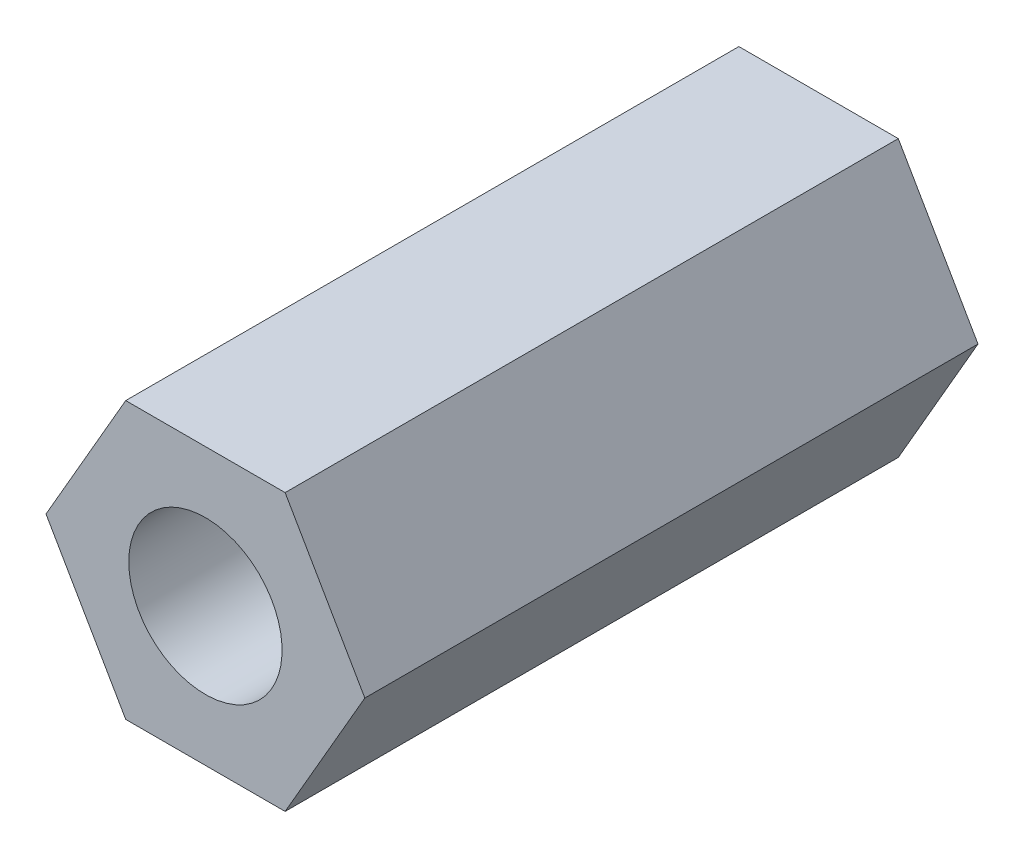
ISO-10303-21;
HEADER;
FILE_DESCRIPTION(('STEP AP214'),'2;1');
FILE_NAME('part.step','',(''),(''),'','','');
FILE_SCHEMA(('AUTOMOTIVE_DESIGN { 1 0 10303 214 1 1 1 1 }'));
ENDSEC;
DATA;
#1=APPLICATION_CONTEXT('core data for automotive mechanical design processes');
#2=APPLICATION_PROTOCOL_DEFINITION('international standard','automotive_design',2000,#1);
#3=PRODUCT_CONTEXT('',#1,'mechanical');
#4=PRODUCT('Part','Part','',(#3));
#5=PRODUCT_RELATED_PRODUCT_CATEGORY('part','',(#4));
#6=PRODUCT_DEFINITION_FORMATION('','',#4);
#7=PRODUCT_DEFINITION_CONTEXT('part definition',#1,'design');
#8=PRODUCT_DEFINITION('design','',#6,#7);
#9=PRODUCT_DEFINITION_SHAPE('','',#8);
#10=(LENGTH_UNIT() NAMED_UNIT(*) SI_UNIT(.MILLI.,.METRE.));
#11=(NAMED_UNIT(*) PLANE_ANGLE_UNIT() SI_UNIT($,.RADIAN.));
#12=(NAMED_UNIT(*) SI_UNIT($,.STERADIAN.) SOLID_ANGLE_UNIT());
#13=UNCERTAINTY_MEASURE_WITH_UNIT(LENGTH_MEASURE(1.E-05),#10,'distance_accuracy_value','');
#14=(GEOMETRIC_REPRESENTATION_CONTEXT(3) GLOBAL_UNCERTAINTY_ASSIGNED_CONTEXT((#13)) GLOBAL_UNIT_ASSIGNED_CONTEXT((#10,
#11,#12)) REPRESENTATION_CONTEXT('',''));
#15=CARTESIAN_POINT('',(0.,0.,0.));
#16=DIRECTION('',(0.,0.,1.));
#17=DIRECTION('',(1.,0.,0.));
#18=AXIS2_PLACEMENT_3D('',#15,#16,#17);
#19=CARTESIAN_POINT('',(1.3,-2.25166604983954,10.));
#20=DIRECTION('',(-0.866025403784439,0.5,0.));
#21=DIRECTION('',(-0.5,-0.866025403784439,0.));
#22=AXIS2_PLACEMENT_3D('',#19,#20,#21);
#23=PLANE('',#22);
#24=DIRECTION('',(0.5,0.866025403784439,0.));
#25=VECTOR('',#24,1.);
#26=CARTESIAN_POINT('',(1.3,-2.25166604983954,0.));
#27=LINE('',#26,#25);
#28=CARTESIAN_POINT('',(1.3,-2.25166604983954,0.));
#29=VERTEX_POINT('',#28);
#30=CARTESIAN_POINT('',(2.6,0.,0.));
#31=VERTEX_POINT('',#30);
#32=EDGE_CURVE('E123',#29,#31,#27,.T.);
#33=ORIENTED_EDGE('',*,*,#32,.T.);
#34=DIRECTION('',(0.,0.,-1.));
#35=VECTOR('',#34,1.);
#36=CARTESIAN_POINT('',(2.6,0.,10.));
#37=LINE('',#36,#35);
#38=CARTESIAN_POINT('',(2.6,0.,10.));
#39=VERTEX_POINT('',#38);
#40=EDGE_CURVE('E11',#39,#31,#37,.T.);
#41=ORIENTED_EDGE('',*,*,#40,.F.);
#42=DIRECTION('',(0.5,0.866025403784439,0.));
#43=VECTOR('',#42,1.);
#44=CARTESIAN_POINT('',(1.3,-2.25166604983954,10.));
#45=LINE('',#44,#43);
#46=CARTESIAN_POINT('',(1.3,-2.25166604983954,10.));
#47=VERTEX_POINT('',#46);
#48=EDGE_CURVE('E134',#47,#39,#45,.T.);
#49=ORIENTED_EDGE('',*,*,#48,.F.);
#50=DIRECTION('',(0.,0.,-1.));
#51=VECTOR('',#50,1.);
#52=CARTESIAN_POINT('',(1.3,-2.25166604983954,10.));
#53=LINE('',#52,#51);
#54=EDGE_CURVE('E119',#47,#29,#53,.T.);
#55=ORIENTED_EDGE('',*,*,#54,.T.);
#56=EDGE_LOOP('',(#33,#41,#49,#55));
#57=FACE_BOUND('',#56,.T.);
#58=ADVANCED_FACE('F39',(#57),#23,.F.);
#59=CARTESIAN_POINT('',(2.6,0.,10.));
#60=DIRECTION('',(-0.866025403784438,-0.5,0.));
#61=DIRECTION('',(0.5,-0.866025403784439,0.));
#62=AXIS2_PLACEMENT_3D('',#59,#60,#61);
#63=PLANE('',#62);
#64=DIRECTION('',(-0.5,0.866025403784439,0.));
#65=VECTOR('',#64,1.);
#66=CARTESIAN_POINT('',(2.6,0.,0.));
#67=LINE('',#66,#65);
#68=CARTESIAN_POINT('',(1.3,2.25166604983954,0.));
#69=VERTEX_POINT('',#68);
#70=EDGE_CURVE('E126',#31,#69,#67,.T.);
#71=ORIENTED_EDGE('',*,*,#70,.T.);
#72=DIRECTION('',(0.,0.,-1.));
#73=VECTOR('',#72,1.);
#74=CARTESIAN_POINT('',(1.3,2.25166604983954,10.));
#75=LINE('',#74,#73);
#76=CARTESIAN_POINT('',(1.3,2.25166604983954,10.));
#77=VERTEX_POINT('',#76);
#78=EDGE_CURVE('E47',#77,#69,#75,.T.);
#79=ORIENTED_EDGE('',*,*,#78,.F.);
#80=DIRECTION('',(-0.5,0.866025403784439,0.));
#81=VECTOR('',#80,1.);
#82=CARTESIAN_POINT('',(2.6,0.,10.));
#83=LINE('',#82,#81);
#84=EDGE_CURVE('E92',#39,#77,#83,.T.);
#85=ORIENTED_EDGE('',*,*,#84,.F.);
#86=ORIENTED_EDGE('',*,*,#40,.T.);
#87=EDGE_LOOP('',(#71,#79,#85,#86));
#88=FACE_BOUND('',#87,.T.);
#89=ADVANCED_FACE('F159',(#88),#63,.F.);
#90=CARTESIAN_POINT('',(1.3,2.25166604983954,10.));
#91=DIRECTION('',(0.,-1.,0.));
#92=DIRECTION('',(0.,0.,-1.));
#93=AXIS2_PLACEMENT_3D('',#90,#91,#92);
#94=PLANE('',#93);
#95=DIRECTION('',(-1.,0.,0.));
#96=VECTOR('',#95,1.);
#97=CARTESIAN_POINT('',(1.3,2.25166604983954,0.));
#98=LINE('',#97,#96);
#99=CARTESIAN_POINT('',(-1.3,2.25166604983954,0.));
#100=VERTEX_POINT('',#99);
#101=EDGE_CURVE('E129',#69,#100,#98,.T.);
#102=ORIENTED_EDGE('',*,*,#101,.T.);
#103=DIRECTION('',(0.,0.,-1.));
#104=VECTOR('',#103,1.);
#105=CARTESIAN_POINT('',(-1.3,2.25166604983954,10.));
#106=LINE('',#105,#104);
#107=CARTESIAN_POINT('',(-1.3,2.25166604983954,10.));
#108=VERTEX_POINT('',#107);
#109=EDGE_CURVE('E114',#108,#100,#106,.T.);
#110=ORIENTED_EDGE('',*,*,#109,.F.);
#111=DIRECTION('',(-1.,0.,0.));
#112=VECTOR('',#111,1.);
#113=CARTESIAN_POINT('',(1.3,2.25166604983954,10.));
#114=LINE('',#113,#112);
#115=EDGE_CURVE('E105',#77,#108,#114,.T.);
#116=ORIENTED_EDGE('',*,*,#115,.F.);
#117=ORIENTED_EDGE('',*,*,#78,.T.);
#118=EDGE_LOOP('',(#102,#110,#116,#117));
#119=FACE_BOUND('',#118,.T.);
#120=ADVANCED_FACE('F140',(#119),#94,.F.);
#121=CARTESIAN_POINT('',(-1.3,2.25166604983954,10.));
#122=DIRECTION('',(0.866025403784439,-0.5,0.));
#123=DIRECTION('',(0.5,0.866025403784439,0.));
#124=AXIS2_PLACEMENT_3D('',#121,#122,#123);
#125=PLANE('',#124);
#126=DIRECTION('',(-0.5,-0.866025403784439,0.));
#127=VECTOR('',#126,1.);
#128=CARTESIAN_POINT('',(-1.3,2.25166604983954,0.));
#129=LINE('',#128,#127);
#130=CARTESIAN_POINT('',(-2.6,0.,0.));
#131=VERTEX_POINT('',#130);
#132=EDGE_CURVE('E113',#100,#131,#129,.T.);
#133=ORIENTED_EDGE('',*,*,#132,.T.);
#134=DIRECTION('',(0.,0.,-1.));
#135=VECTOR('',#134,1.);
#136=CARTESIAN_POINT('',(-2.6,0.,10.));
#137=LINE('',#136,#135);
#138=CARTESIAN_POINT('',(-2.6,0.,10.));
#139=VERTEX_POINT('',#138);
#140=EDGE_CURVE('E110',#139,#131,#137,.T.);
#141=ORIENTED_EDGE('',*,*,#140,.F.);
#142=DIRECTION('',(-0.5,-0.866025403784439,0.));
#143=VECTOR('',#142,1.);
#144=CARTESIAN_POINT('',(-1.3,2.25166604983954,10.));
#145=LINE('',#144,#143);
#146=EDGE_CURVE('E99',#108,#139,#145,.T.);
#147=ORIENTED_EDGE('',*,*,#146,.F.);
#148=ORIENTED_EDGE('',*,*,#109,.T.);
#149=EDGE_LOOP('',(#133,#141,#147,#148));
#150=FACE_BOUND('',#149,.T.);
#151=ADVANCED_FACE('F111',(#150),#125,.F.);
#152=CARTESIAN_POINT('',(-2.6,0.,10.));
#153=DIRECTION('',(0.866025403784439,0.5,0.));
#154=DIRECTION('',(-0.5,0.866025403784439,0.));
#155=AXIS2_PLACEMENT_3D('',#152,#153,#154);
#156=PLANE('',#155);
#157=DIRECTION('',(0.5,-0.866025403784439,0.));
#158=VECTOR('',#157,1.);
#159=CARTESIAN_POINT('',(-2.6,0.,0.));
#160=LINE('',#159,#158);
#161=CARTESIAN_POINT('',(-1.3,-2.25166604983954,0.));
#162=VERTEX_POINT('',#161);
#163=EDGE_CURVE('E78',#131,#162,#160,.T.);
#164=ORIENTED_EDGE('',*,*,#163,.T.);
#165=DIRECTION('',(0.,0.,-1.));
#166=VECTOR('',#165,1.);
#167=CARTESIAN_POINT('',(-1.3,-2.25166604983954,10.));
#168=LINE('',#167,#166);
#169=CARTESIAN_POINT('',(-1.3,-2.25166604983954,10.));
#170=VERTEX_POINT('',#169);
#171=EDGE_CURVE('E115',#170,#162,#168,.T.);
#172=ORIENTED_EDGE('',*,*,#171,.F.);
#173=DIRECTION('',(0.5,-0.866025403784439,0.));
#174=VECTOR('',#173,1.);
#175=CARTESIAN_POINT('',(-2.6,0.,10.));
#176=LINE('',#175,#174);
#177=EDGE_CURVE('E103',#139,#170,#176,.T.);
#178=ORIENTED_EDGE('',*,*,#177,.F.);
#179=ORIENTED_EDGE('',*,*,#140,.T.);
#180=EDGE_LOOP('',(#164,#172,#178,#179));
#181=FACE_BOUND('',#180,.T.);
#182=ADVANCED_FACE('F117',(#181),#156,.F.);
#183=CARTESIAN_POINT('',(-1.3,-2.25166604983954,10.));
#184=DIRECTION('',(0.,1.,0.));
#185=DIRECTION('',(-1.,0.,0.));
#186=AXIS2_PLACEMENT_3D('',#183,#184,#185);
#187=PLANE('',#186);
#188=DIRECTION('',(1.,0.,0.));
#189=VECTOR('',#188,1.);
#190=CARTESIAN_POINT('',(-1.3,-2.25166604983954,0.));
#191=LINE('',#190,#189);
#192=EDGE_CURVE('E84',#162,#29,#191,.T.);
#193=ORIENTED_EDGE('',*,*,#192,.T.);
#194=ORIENTED_EDGE('',*,*,#54,.F.);
#195=DIRECTION('',(1.,0.,0.));
#196=VECTOR('',#195,1.);
#197=CARTESIAN_POINT('',(-1.3,-2.25166604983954,10.));
#198=LINE('',#197,#196);
#199=EDGE_CURVE('E55',#170,#47,#198,.T.);
#200=ORIENTED_EDGE('',*,*,#199,.F.);
#201=ORIENTED_EDGE('',*,*,#171,.T.);
#202=EDGE_LOOP('',(#193,#194,#200,#201));
#203=FACE_BOUND('',#202,.T.);
#204=ADVANCED_FACE('F147',(#203),#187,.F.);
#205=CARTESIAN_POINT('',(0.,0.,10.));
#206=DIRECTION('',(0.,0.,1.));
#207=DIRECTION('',(1.,0.,0.));
#208=AXIS2_PLACEMENT_3D('',#205,#206,#207);
#209=PLANE('',#208);
#210=CARTESIAN_POINT('',(0.,0.,10.));
#211=DIRECTION('',(0.,0.,-1.));
#212=DIRECTION('',(-1.,0.,0.));
#213=AXIS2_PLACEMENT_3D('',#210,#211,#212);
#214=CIRCLE('',#213,1.25);
#215=CARTESIAN_POINT('',(-1.25,0.,10.));
#216=VERTEX_POINT('',#215);
#217=EDGE_CURVE('E127',#216,#216,#214,.T.);
#218=ORIENTED_EDGE('',*,*,#217,.T.);
#219=EDGE_LOOP('',(#218));
#220=FACE_BOUND('',#219,.T.);
#221=ORIENTED_EDGE('',*,*,#48,.T.);
#222=ORIENTED_EDGE('',*,*,#84,.T.);
#223=ORIENTED_EDGE('',*,*,#115,.T.);
#224=ORIENTED_EDGE('',*,*,#146,.T.);
#225=ORIENTED_EDGE('',*,*,#177,.T.);
#226=ORIENTED_EDGE('',*,*,#199,.T.);
#227=EDGE_LOOP('',(#221,#222,#223,#224,#225,#226));
#228=FACE_BOUND('',#227,.T.);
#229=ADVANCED_FACE('F101',(#220,#228),#209,.T.);
#230=CARTESIAN_POINT('',(0.,0.,0.));
#231=DIRECTION('',(0.,0.,1.));
#232=DIRECTION('',(1.,0.,0.));
#233=AXIS2_PLACEMENT_3D('',#230,#231,#232);
#234=PLANE('',#233);
#235=CARTESIAN_POINT('',(0.,0.,0.));
#236=DIRECTION('',(0.,0.,-1.));
#237=DIRECTION('',(-1.,0.,0.));
#238=AXIS2_PLACEMENT_3D('',#235,#236,#237);
#239=CIRCLE('',#238,1.24999999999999);
#240=CARTESIAN_POINT('',(-1.24999999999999,0.,0.));
#241=VERTEX_POINT('',#240);
#242=EDGE_CURVE('E227',#241,#241,#239,.T.);
#243=ORIENTED_EDGE('',*,*,#242,.F.);
#244=EDGE_LOOP('',(#243));
#245=FACE_BOUND('',#244,.T.);
#246=ORIENTED_EDGE('',*,*,#32,.F.);
#247=ORIENTED_EDGE('',*,*,#192,.F.);
#248=ORIENTED_EDGE('',*,*,#163,.F.);
#249=ORIENTED_EDGE('',*,*,#132,.F.);
#250=ORIENTED_EDGE('',*,*,#101,.F.);
#251=ORIENTED_EDGE('',*,*,#70,.F.);
#252=EDGE_LOOP('',(#246,#247,#248,#249,#250,#251));
#253=FACE_BOUND('',#252,.T.);
#254=ADVANCED_FACE('F143',(#245,#253),#234,.F.);
#255=CARTESIAN_POINT('',(0.,0.,0.));
#256=DIRECTION('',(0.,0.,-1.));
#257=DIRECTION('',(-1.,0.,0.));
#258=AXIS2_PLACEMENT_3D('',#255,#256,#257);
#259=CYLINDRICAL_SURFACE('',#258,1.24999999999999);
#260=ORIENTED_EDGE('',*,*,#217,.F.);
#261=EDGE_LOOP('',(#260));
#262=FACE_BOUND('',#261,.T.);
#263=ORIENTED_EDGE('',*,*,#242,.T.);
#264=EDGE_LOOP('',(#263));
#265=FACE_BOUND('',#264,.T.);
#266=ADVANCED_FACE('F196',(#262,#265),#259,.F.);
#267=CLOSED_SHELL('',(#58,#89,#120,#151,#182,#204,#229,#254,#266));
#268=MANIFOLD_SOLID_BREP('B2',#267);
#269=ADVANCED_BREP_SHAPE_REPRESENTATION('',(#18,#268),#14);
#270=SHAPE_DEFINITION_REPRESENTATION(#9,#269);
ENDSEC;
END-ISO-10303-21;
